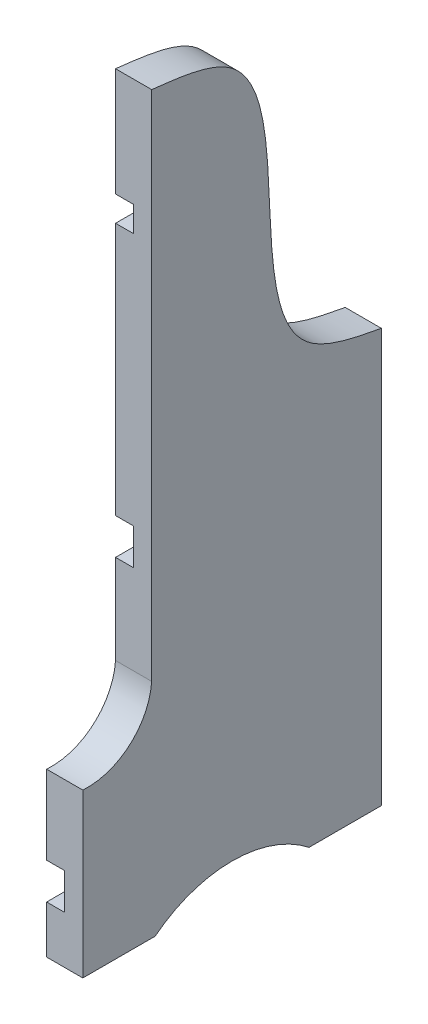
from build123d import *

# Parameters (mm, degrees)
EXTRUDE1_DEPTH     = 10
SKETCH2_W          = 32.782625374
SKETCH2_H          = 7
CUT_EXTRUDE1_DEPTH = 5
SKETCH3_W          = 63.684742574
SKETCH3_H          = 10
CUT_EXTRUDE3_DEPTH = 5
SKETCH4_W          = 83.265898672
SKETCH4_H          = 10
CUT_EXTRUDE4_DEPTH = 5


with BuildPart() as part:
    # Sketch1 → Extrude1 (new body)
    with BuildSketch(Plane(origin=(0, 0, 0), x_dir=(0, 0, -1), z_dir=(1, 0, 0))):
        with BuildLine():
            Line((-51.940954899, 0), (-31.940954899, 0))
            ThreePointArc((-31.940954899, 0), (-10.665954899, 7.37309837), (10.609045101, 0))
            Line((10.609045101, 0), (30.609045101, 0))
            Line((30.609045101, 0), (30.609045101, 114.299997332))
            add(Edge.make_bspline(
                [(-32.890954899, 203.2), (-24.789360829, 202.284365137), (12.398409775, 198.081436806), (-12.725636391, 122.379582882), (23.136829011, 115.693163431), (30.609045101, 114.299997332)],
                knots=[0, 0, 0, 0, 0.180665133, 0.829285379, 1, 1, 1, 1], degree=3))
            Line((-32.890954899, 203.2), (-32.890954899, 61.49789055))
            ThreePointArc((-32.890954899, 61.49789055), (-38.999129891, 49.303561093), (-51.940954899, 45))
            Line((-51.940954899, 45), (-51.940954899, 0))
        make_face()
    extrude(amount=EXTRUDE1_DEPTH)

    # Sketch2 → Cut-Extrude1 (cut)
    with BuildSketch(Plane(origin=(0, 0, 0), x_dir=(0, 0, -1), z_dir=(1, 0, 0))):
        with Locations((-17.013724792, 169.7)):
            Rectangle(SKETCH2_W, SKETCH2_H)
    extrude(amount=CUT_EXTRUDE1_DEPTH, mode=Mode.SUBTRACT)

    # Sketch3 → Cut-Extrude3 (cut)
    with BuildSketch(Plane(origin=(0, 0, 0), x_dir=(0, 0, -1), z_dir=(1, 0, 0))):
        with Locations((-1.233326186, 91.2)):
            Rectangle(SKETCH3_W, SKETCH3_H)
    extrude(amount=CUT_EXTRUDE3_DEPTH, mode=Mode.SUBTRACT)

    # Sketch4 → Cut-Extrude4 (cut)
    with BuildSketch(Plane(origin=(0, 0, 0), x_dir=(0, 0, -1), z_dir=(1, 0, 0))):
        with Locations((-10.718921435, 18.2)):
            Rectangle(SKETCH4_W, SKETCH4_H)
    extrude(amount=CUT_EXTRUDE4_DEPTH, mode=Mode.SUBTRACT)


solid = part.part
